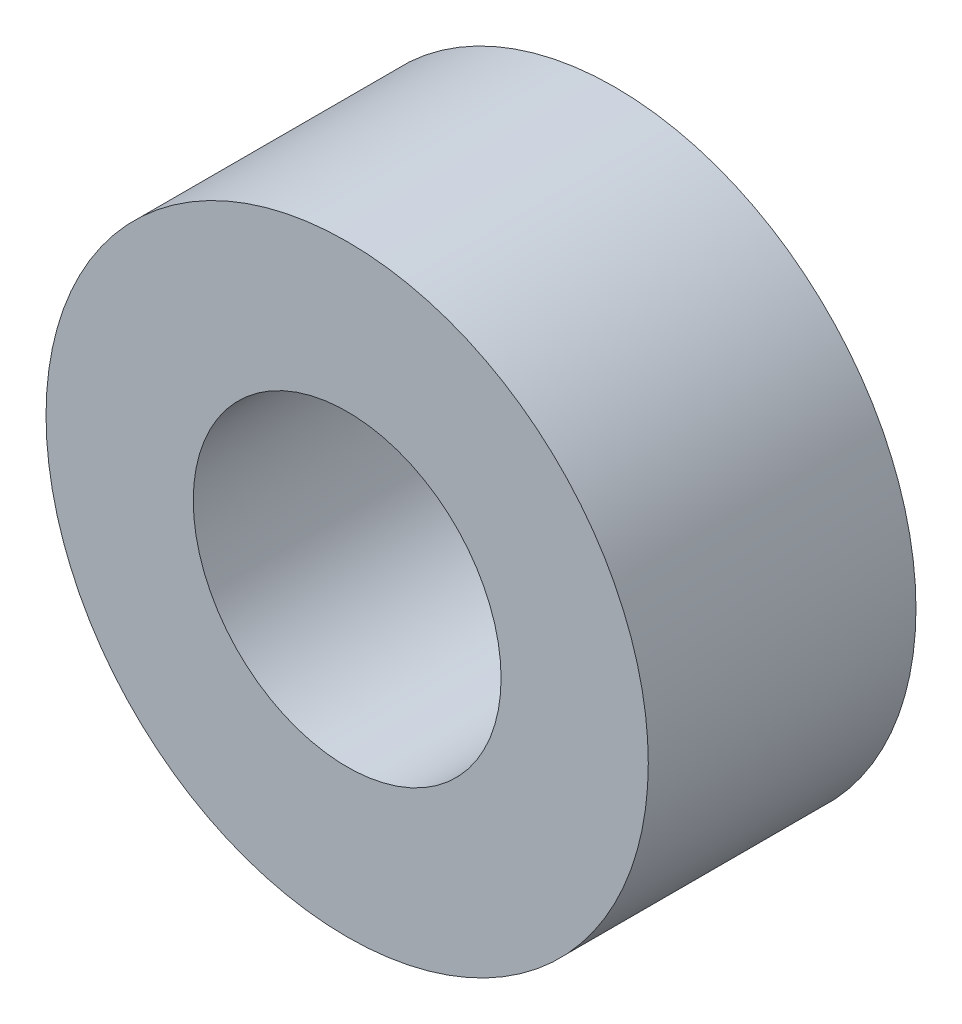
from build123d import *

# Parameters (mm, degrees)
ESQUISSE1_R        = 9
ESQUISSE1_R_2      = 4.6
BOSS_EXTRU_1_DEPTH = 8


with BuildPart() as part:
    # Esquisse1 → Boss.-Extru.1 (new body)
    with BuildSketch(Plane.XY):
        Circle(ESQUISSE1_R)
        Circle(ESQUISSE1_R_2, mode=Mode.SUBTRACT)
    extrude(amount=BOSS_EXTRU_1_DEPTH)


solid = part.part
